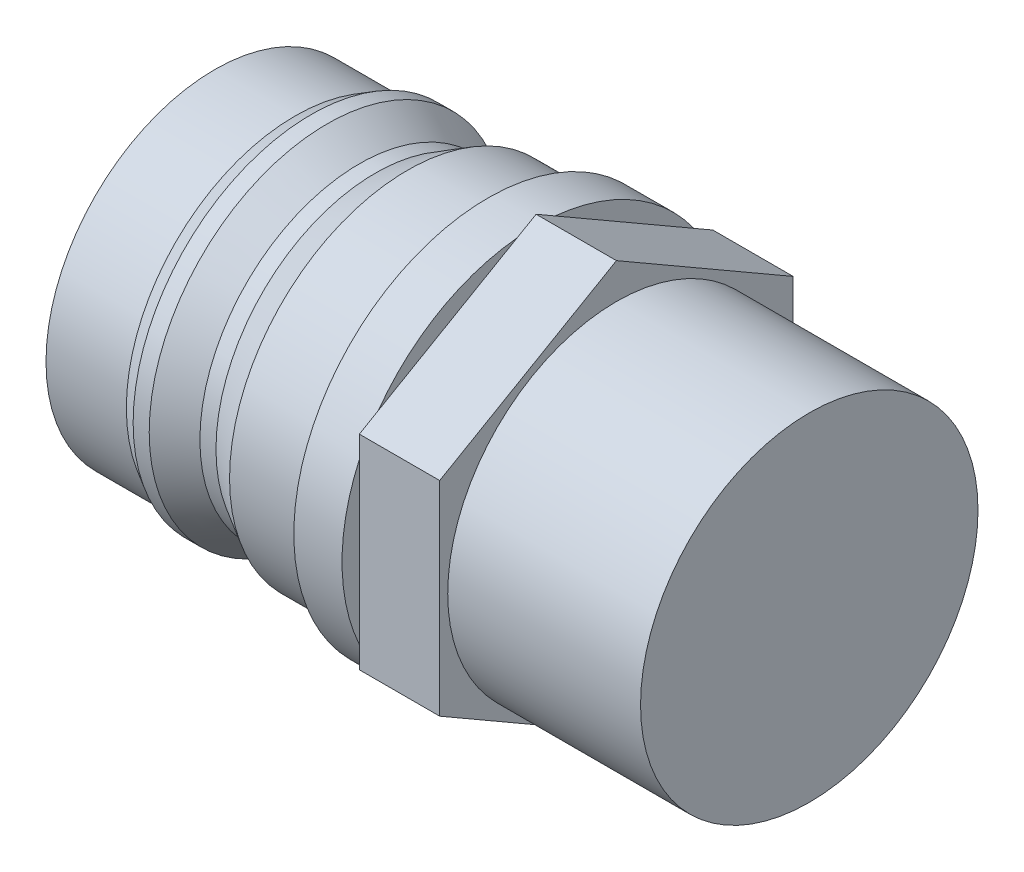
ISO-10303-21;
HEADER;
FILE_DESCRIPTION(('STEP AP214'),'2;1');
FILE_NAME('part.step','',(''),(''),'','','');
FILE_SCHEMA(('AUTOMOTIVE_DESIGN { 1 0 10303 214 1 1 1 1 }'));
ENDSEC;
DATA;
#1=APPLICATION_CONTEXT('core data for automotive mechanical design processes');
#2=APPLICATION_PROTOCOL_DEFINITION('international standard','automotive_design',2000,#1);
#3=PRODUCT_CONTEXT('',#1,'mechanical');
#4=PRODUCT('Part','Part','',(#3));
#5=PRODUCT_RELATED_PRODUCT_CATEGORY('part','',(#4));
#6=PRODUCT_DEFINITION_FORMATION('','',#4);
#7=PRODUCT_DEFINITION_CONTEXT('part definition',#1,'design');
#8=PRODUCT_DEFINITION('design','',#6,#7);
#9=PRODUCT_DEFINITION_SHAPE('','',#8);
#10=(LENGTH_UNIT() NAMED_UNIT(*) SI_UNIT(.MILLI.,.METRE.));
#11=(NAMED_UNIT(*) PLANE_ANGLE_UNIT() SI_UNIT($,.RADIAN.));
#12=(NAMED_UNIT(*) SI_UNIT($,.STERADIAN.) SOLID_ANGLE_UNIT());
#13=UNCERTAINTY_MEASURE_WITH_UNIT(LENGTH_MEASURE(1.E-05),#10,'distance_accuracy_value','');
#14=(GEOMETRIC_REPRESENTATION_CONTEXT(3) GLOBAL_UNCERTAINTY_ASSIGNED_CONTEXT((#13)) GLOBAL_UNIT_ASSIGNED_CONTEXT((#10,
#11,#12)) REPRESENTATION_CONTEXT('',''));
#15=CARTESIAN_POINT('',(0.,0.,0.));
#16=DIRECTION('',(0.,0.,1.));
#17=DIRECTION('',(1.,0.,0.));
#18=AXIS2_PLACEMENT_3D('',#15,#16,#17);
#19=CARTESIAN_POINT('',(20.,12.0773502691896,0.));
#20=DIRECTION('',(1.,0.,0.));
#21=DIRECTION('',(0.,0.,-1.));
#22=AXIS2_PLACEMENT_3D('',#19,#20,#21);
#23=PLANE('',#22);
#24=DIRECTION('',(0.,0.5,0.866025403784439));
#25=VECTOR('',#24,1.);
#26=CARTESIAN_POINT('',(20.,6.35085296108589,-11.));
#27=LINE('',#26,#25);
#28=CARTESIAN_POINT('',(20.,7.03316945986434,-9.81819315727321));
#29=VERTEX_POINT('',#28);
#30=CARTESIAN_POINT('',(20.,12.0193894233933,-1.1818068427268));
#31=VERTEX_POINT('',#30);
#32=EDGE_CURVE('E11',#29,#31,#27,.T.);
#33=ORIENTED_EDGE('',*,*,#32,.F.);
#34=CARTESIAN_POINT('',(20.,0.,0.));
#35=DIRECTION('',(1.,0.,0.));
#36=DIRECTION('',(0.,0.,-1.));
#37=AXIS2_PLACEMENT_3D('',#34,#35,#36);
#38=CIRCLE('',#37,12.0773502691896);
#39=EDGE_CURVE('E162',#29,#31,#38,.T.);
#40=ORIENTED_EDGE('',*,*,#39,.T.);
#41=EDGE_LOOP('',(#33,#40));
#42=FACE_BOUND('',#41,.T.);
#43=ADVANCED_FACE('F33',(#42),#23,.T.);
#44=DIRECTION('',(0.,1.,0.));
#45=VECTOR('',#44,1.);
#46=CARTESIAN_POINT('',(20.,-6.35085296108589,-11.));
#47=LINE('',#46,#45);
#48=CARTESIAN_POINT('',(20.,-4.98621996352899,-11.));
#49=VERTEX_POINT('',#48);
#50=CARTESIAN_POINT('',(20.,4.98621996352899,-11.));
#51=VERTEX_POINT('',#50);
#52=EDGE_CURVE('E42',#49,#51,#47,.T.);
#53=ORIENTED_EDGE('',*,*,#52,.F.);
#54=EDGE_CURVE('E152',#49,#51,#38,.T.);
#55=ORIENTED_EDGE('',*,*,#54,.T.);
#56=EDGE_LOOP('',(#53,#55));
#57=FACE_BOUND('',#56,.T.);
#58=ADVANCED_FACE('F228',(#57),#23,.T.);
#59=DIRECTION('',(0.,0.5,-0.866025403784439));
#60=VECTOR('',#59,1.);
#61=CARTESIAN_POINT('',(20.,-12.7017059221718,0.));
#62=LINE('',#61,#60);
#63=CARTESIAN_POINT('',(20.,-12.0193894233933,-1.18180684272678));
#64=VERTEX_POINT('',#63);
#65=CARTESIAN_POINT('',(20.,-7.03316945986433,-9.81819315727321));
#66=VERTEX_POINT('',#65);
#67=EDGE_CURVE('E292',#64,#66,#62,.T.);
#68=ORIENTED_EDGE('',*,*,#67,.F.);
#69=EDGE_CURVE('E316',#64,#66,#38,.T.);
#70=ORIENTED_EDGE('',*,*,#69,.T.);
#71=EDGE_LOOP('',(#68,#70));
#72=FACE_BOUND('',#71,.T.);
#73=ADVANCED_FACE('F235',(#72),#23,.T.);
#74=DIRECTION('',(0.,-0.5,-0.866025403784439));
#75=VECTOR('',#74,1.);
#76=CARTESIAN_POINT('',(20.,-6.35085296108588,11.));
#77=LINE('',#76,#75);
#78=CARTESIAN_POINT('',(20.,-7.03316945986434,9.81819315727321));
#79=VERTEX_POINT('',#78);
#80=CARTESIAN_POINT('',(20.,-12.0193894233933,1.1818068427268));
#81=VERTEX_POINT('',#80);
#82=EDGE_CURVE('E196',#79,#81,#77,.T.);
#83=ORIENTED_EDGE('',*,*,#82,.F.);
#84=EDGE_CURVE('E311',#79,#81,#38,.T.);
#85=ORIENTED_EDGE('',*,*,#84,.T.);
#86=EDGE_LOOP('',(#83,#85));
#87=FACE_BOUND('',#86,.T.);
#88=ADVANCED_FACE('F254',(#87),#23,.T.);
#89=DIRECTION('',(0.,-1.,0.));
#90=VECTOR('',#89,1.);
#91=CARTESIAN_POINT('',(20.,6.35085296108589,11.));
#92=LINE('',#91,#90);
#93=CARTESIAN_POINT('',(20.,4.98621996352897,11.));
#94=VERTEX_POINT('',#93);
#95=CARTESIAN_POINT('',(20.,-4.98621996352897,11.));
#96=VERTEX_POINT('',#95);
#97=EDGE_CURVE('E191',#94,#96,#92,.T.);
#98=ORIENTED_EDGE('',*,*,#97,.F.);
#99=EDGE_CURVE('E265',#94,#96,#38,.T.);
#100=ORIENTED_EDGE('',*,*,#99,.T.);
#101=EDGE_LOOP('',(#98,#100));
#102=FACE_BOUND('',#101,.T.);
#103=ADVANCED_FACE('F242',(#102),#23,.T.);
#104=CARTESIAN_POINT('',(0.,0.,0.));
#105=DIRECTION('',(-1.,0.,0.));
#106=DIRECTION('',(0.,0.,1.));
#107=AXIS2_PLACEMENT_3D('',#104,#105,#106);
#108=PLANE('',#107);
#109=CARTESIAN_POINT('',(0.,0.,0.));
#110=DIRECTION('',(1.,0.,0.));
#111=DIRECTION('',(0.,0.,-1.));
#112=AXIS2_PLACEMENT_3D('',#109,#110,#111);
#113=CIRCLE('',#112,10.5);
#114=CARTESIAN_POINT('',(0.,0.,-10.5));
#115=VERTEX_POINT('',#114);
#116=EDGE_CURVE('E37',#115,#115,#113,.T.);
#117=ORIENTED_EDGE('',*,*,#116,.F.);
#118=EDGE_LOOP('',(#117));
#119=FACE_BOUND('',#118,.T.);
#120=ADVANCED_FACE('F35',(#119),#108,.T.);
#121=CARTESIAN_POINT('',(20.,0.,0.));
#122=DIRECTION('',(1.,0.,0.));
#123=DIRECTION('',(0.,0.,-1.));
#124=AXIS2_PLACEMENT_3D('',#121,#122,#123);
#125=CYLINDRICAL_SURFACE('',#124,10.5);
#126=ORIENTED_EDGE('',*,*,#116,.T.);
#127=EDGE_LOOP('',(#126));
#128=FACE_BOUND('',#127,.T.);
#129=CARTESIAN_POINT('',(5.,0.,0.));
#130=DIRECTION('',(1.,0.,0.));
#131=DIRECTION('',(0.,0.,-1.));
#132=AXIS2_PLACEMENT_3D('',#129,#130,#131);
#133=CIRCLE('',#132,10.5);
#134=CARTESIAN_POINT('',(5.,0.,-10.5));
#135=VERTEX_POINT('',#134);
#136=EDGE_CURVE('E182',#135,#135,#133,.T.);
#137=ORIENTED_EDGE('',*,*,#136,.F.);
#138=EDGE_LOOP('',(#137));
#139=FACE_BOUND('',#138,.T.);
#140=ADVANCED_FACE('F260',(#128,#139),#125,.T.);
#141=CARTESIAN_POINT('',(6.,0.,0.));
#142=DIRECTION('',(1.,0.,0.));
#143=DIRECTION('',(0.,0.,-1.));
#144=AXIS2_PLACEMENT_3D('',#141,#142,#143);
#145=CONICAL_SURFACE('',#144,11.0773502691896,0.523598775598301);
#146=ORIENTED_EDGE('',*,*,#136,.T.);
#147=EDGE_LOOP('',(#146));
#148=FACE_BOUND('',#147,.T.);
#149=CARTESIAN_POINT('',(6.,0.,0.));
#150=DIRECTION('',(1.,0.,0.));
#151=DIRECTION('',(0.,0.,-1.));
#152=AXIS2_PLACEMENT_3D('',#149,#150,#151);
#153=CIRCLE('',#152,11.0773502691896);
#154=CARTESIAN_POINT('',(6.,0.,-11.0773502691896));
#155=VERTEX_POINT('',#154);
#156=EDGE_CURVE('E180',#155,#155,#153,.T.);
#157=ORIENTED_EDGE('',*,*,#156,.F.);
#158=EDGE_LOOP('',(#157));
#159=FACE_BOUND('',#158,.T.);
#160=ADVANCED_FACE('F525',(#148,#159),#145,.T.);
#161=CARTESIAN_POINT('',(20.,0.,0.));
#162=DIRECTION('',(1.,0.,0.));
#163=DIRECTION('',(0.,0.,-1.));
#164=AXIS2_PLACEMENT_3D('',#161,#162,#163);
#165=CYLINDRICAL_SURFACE('',#164,11.0773502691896);
#166=ORIENTED_EDGE('',*,*,#156,.T.);
#167=EDGE_LOOP('',(#166));
#168=FACE_BOUND('',#167,.T.);
#169=CARTESIAN_POINT('',(7.,0.,0.));
#170=DIRECTION('',(1.,0.,0.));
#171=DIRECTION('',(0.,0.,-1.));
#172=AXIS2_PLACEMENT_3D('',#169,#170,#171);
#173=CIRCLE('',#172,11.0773502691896);
#174=CARTESIAN_POINT('',(7.,0.,-11.0773502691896));
#175=VERTEX_POINT('',#174);
#176=EDGE_CURVE('E177',#175,#175,#173,.T.);
#177=ORIENTED_EDGE('',*,*,#176,.F.);
#178=EDGE_LOOP('',(#177));
#179=FACE_BOUND('',#178,.T.);
#180=ADVANCED_FACE('F514',(#168,#179),#165,.T.);
#181=CARTESIAN_POINT('',(9.,0.,0.));
#182=DIRECTION('',(-1.,0.,0.));
#183=DIRECTION('',(0.,0.,1.));
#184=AXIS2_PLACEMENT_3D('',#181,#182,#183);
#185=CONICAL_SURFACE('',#184,9.92264973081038,0.523598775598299);
#186=ORIENTED_EDGE('',*,*,#176,.T.);
#187=EDGE_LOOP('',(#186));
#188=FACE_BOUND('',#187,.T.);
#189=CARTESIAN_POINT('',(9.,0.,0.));
#190=DIRECTION('',(1.,0.,0.));
#191=DIRECTION('',(0.,0.,-1.));
#192=AXIS2_PLACEMENT_3D('',#189,#190,#191);
#193=CIRCLE('',#192,9.92264973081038);
#194=CARTESIAN_POINT('',(9.,0.,-9.92264973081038));
#195=VERTEX_POINT('',#194);
#196=EDGE_CURVE('E174',#195,#195,#193,.T.);
#197=ORIENTED_EDGE('',*,*,#196,.F.);
#198=EDGE_LOOP('',(#197));
#199=FACE_BOUND('',#198,.T.);
#200=ADVANCED_FACE('F504',(#188,#199),#185,.T.);
#201=CARTESIAN_POINT('',(20.,0.,0.));
#202=DIRECTION('',(1.,0.,0.));
#203=DIRECTION('',(0.,0.,-1.));
#204=AXIS2_PLACEMENT_3D('',#201,#202,#203);
#205=CYLINDRICAL_SURFACE('',#204,9.92264973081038);
#206=ORIENTED_EDGE('',*,*,#196,.T.);
#207=EDGE_LOOP('',(#206));
#208=FACE_BOUND('',#207,.T.);
#209=CARTESIAN_POINT('',(10.,0.,0.));
#210=DIRECTION('',(1.,0.,0.));
#211=DIRECTION('',(0.,0.,-1.));
#212=AXIS2_PLACEMENT_3D('',#209,#210,#211);
#213=CIRCLE('',#212,9.92264973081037);
#214=CARTESIAN_POINT('',(10.,0.,-9.92264973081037));
#215=VERTEX_POINT('',#214);
#216=EDGE_CURVE('E171',#215,#215,#213,.T.);
#217=ORIENTED_EDGE('',*,*,#216,.F.);
#218=EDGE_LOOP('',(#217));
#219=FACE_BOUND('',#218,.T.);
#220=ADVANCED_FACE('F492',(#208,#219),#205,.T.);
#221=CARTESIAN_POINT('',(12.,0.,0.));
#222=DIRECTION('',(1.,0.,0.));
#223=DIRECTION('',(0.,0.,-1.));
#224=AXIS2_PLACEMENT_3D('',#221,#222,#223);
#225=CONICAL_SURFACE('',#224,11.0773502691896,0.523598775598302);
#226=ORIENTED_EDGE('',*,*,#216,.T.);
#227=EDGE_LOOP('',(#226));
#228=FACE_BOUND('',#227,.T.);
#229=CARTESIAN_POINT('',(12.,0.,0.));
#230=DIRECTION('',(1.,0.,0.));
#231=DIRECTION('',(0.,0.,-1.));
#232=AXIS2_PLACEMENT_3D('',#229,#230,#231);
#233=CIRCLE('',#232,11.0773502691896);
#234=CARTESIAN_POINT('',(12.,0.,-11.0773502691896));
#235=VERTEX_POINT('',#234);
#236=EDGE_CURVE('E168',#235,#235,#233,.T.);
#237=ORIENTED_EDGE('',*,*,#236,.F.);
#238=EDGE_LOOP('',(#237));
#239=FACE_BOUND('',#238,.T.);
#240=ADVANCED_FACE('F483',(#228,#239),#225,.T.);
#241=CARTESIAN_POINT('',(20.,0.,0.));
#242=DIRECTION('',(1.,0.,0.));
#243=DIRECTION('',(0.,0.,-1.));
#244=AXIS2_PLACEMENT_3D('',#241,#242,#243);
#245=CYLINDRICAL_SURFACE('',#244,11.0773502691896);
#246=ORIENTED_EDGE('',*,*,#236,.T.);
#247=EDGE_LOOP('',(#246));
#248=FACE_BOUND('',#247,.T.);
#249=CARTESIAN_POINT('',(17.,0.,0.));
#250=DIRECTION('',(1.,0.,0.));
#251=DIRECTION('',(0.,0.,-1.));
#252=AXIS2_PLACEMENT_3D('',#249,#250,#251);
#253=CIRCLE('',#252,11.0773502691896);
#254=CARTESIAN_POINT('',(17.,0.,-11.0773502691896));
#255=VERTEX_POINT('',#254);
#256=EDGE_CURVE('E165',#255,#255,#253,.T.);
#257=ORIENTED_EDGE('',*,*,#256,.F.);
#258=EDGE_LOOP('',(#257));
#259=FACE_BOUND('',#258,.T.);
#260=ADVANCED_FACE('F474',(#248,#259),#245,.T.);
#261=CARTESIAN_POINT('',(17.,11.0773502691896,0.));
#262=DIRECTION('',(-1.,0.,0.));
#263=DIRECTION('',(0.,0.,1.));
#264=AXIS2_PLACEMENT_3D('',#261,#262,#263);
#265=PLANE('',#264);
#266=ORIENTED_EDGE('',*,*,#256,.T.);
#267=EDGE_LOOP('',(#266));
#268=FACE_BOUND('',#267,.T.);
#269=CARTESIAN_POINT('',(17.,0.,0.));
#270=DIRECTION('',(1.,0.,0.));
#271=DIRECTION('',(0.,0.,-1.));
#272=AXIS2_PLACEMENT_3D('',#269,#270,#271);
#273=CIRCLE('',#272,12.0773502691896);
#274=CARTESIAN_POINT('',(17.,0.,-12.0773502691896));
#275=VERTEX_POINT('',#274);
#276=EDGE_CURVE('E161',#275,#275,#273,.T.);
#277=ORIENTED_EDGE('',*,*,#276,.F.);
#278=EDGE_LOOP('',(#277));
#279=FACE_BOUND('',#278,.T.);
#280=ADVANCED_FACE('F251',(#268,#279),#265,.T.);
#281=CARTESIAN_POINT('',(20.,0.,0.));
#282=DIRECTION('',(1.,0.,0.));
#283=DIRECTION('',(0.,0.,-1.));
#284=AXIS2_PLACEMENT_3D('',#281,#282,#283);
#285=CYLINDRICAL_SURFACE('',#284,12.0773502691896);
#286=ORIENTED_EDGE('',*,*,#276,.T.);
#287=EDGE_LOOP('',(#286));
#288=FACE_BOUND('',#287,.T.);
#289=EDGE_CURVE('E155',#51,#29,#38,.T.);
#290=ORIENTED_EDGE('',*,*,#289,.F.);
#291=ORIENTED_EDGE('',*,*,#54,.F.);
#292=EDGE_CURVE('E57',#66,#49,#38,.T.);
#293=ORIENTED_EDGE('',*,*,#292,.F.);
#294=ORIENTED_EDGE('',*,*,#69,.F.);
#295=EDGE_CURVE('E313',#81,#64,#38,.T.);
#296=ORIENTED_EDGE('',*,*,#295,.F.);
#297=ORIENTED_EDGE('',*,*,#84,.F.);
#298=EDGE_CURVE('E276',#96,#79,#38,.T.);
#299=ORIENTED_EDGE('',*,*,#298,.F.);
#300=ORIENTED_EDGE('',*,*,#99,.F.);
#301=CARTESIAN_POINT('',(20.,7.03316945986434,9.81819315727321));
#302=VERTEX_POINT('',#301);
#303=EDGE_CURVE('E273',#302,#94,#38,.T.);
#304=ORIENTED_EDGE('',*,*,#303,.F.);
#305=CARTESIAN_POINT('',(20.,12.0193894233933,1.18180684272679));
#306=VERTEX_POINT('',#305);
#307=EDGE_CURVE('E280',#306,#302,#38,.T.);
#308=ORIENTED_EDGE('',*,*,#307,.F.);
#309=EDGE_CURVE('E579',#31,#306,#38,.T.);
#310=ORIENTED_EDGE('',*,*,#309,.F.);
#311=ORIENTED_EDGE('',*,*,#39,.F.);
#312=EDGE_LOOP('',(#290,#291,#293,#294,#296,#297,#299,#300,#304,#308,#310,#311));
#313=FACE_BOUND('',#312,.T.);
#314=ADVANCED_FACE('F240',(#288,#313),#285,.T.);
#315=DIRECTION('',(0.,-0.5,0.866025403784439));
#316=VECTOR('',#315,1.);
#317=CARTESIAN_POINT('',(20.,12.7017059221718,0.));
#318=LINE('',#317,#316);
#319=EDGE_CURVE('E187',#306,#302,#318,.T.);
#320=ORIENTED_EDGE('',*,*,#319,.F.);
#321=ORIENTED_EDGE('',*,*,#307,.T.);
#322=EDGE_LOOP('',(#320,#321));
#323=FACE_BOUND('',#322,.T.);
#324=ADVANCED_FACE('F231',(#323),#23,.T.);
#325=CARTESIAN_POINT('',(20.,0.,0.));
#326=DIRECTION('',(1.,0.,0.));
#327=DIRECTION('',(0.,0.,-1.));
#328=AXIS2_PLACEMENT_3D('',#325,#326,#327);
#329=PLANE('',#328);
#330=CARTESIAN_POINT('',(20.,6.35085296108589,-11.));
#331=VERTEX_POINT('',#330);
#332=EDGE_CURVE('E291',#51,#331,#47,.T.);
#333=ORIENTED_EDGE('',*,*,#332,.F.);
#334=ORIENTED_EDGE('',*,*,#289,.T.);
#335=EDGE_CURVE('E44',#331,#29,#27,.T.);
#336=ORIENTED_EDGE('',*,*,#335,.F.);
#337=EDGE_LOOP('',(#333,#334,#336));
#338=FACE_BOUND('',#337,.T.);
#339=ADVANCED_FACE('F239',(#338),#329,.F.);
#340=CARTESIAN_POINT('',(20.,12.7017059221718,0.));
#341=VERTEX_POINT('',#340);
#342=EDGE_CURVE('E45',#31,#341,#27,.T.);
#343=ORIENTED_EDGE('',*,*,#342,.F.);
#344=ORIENTED_EDGE('',*,*,#309,.T.);
#345=EDGE_CURVE('E193',#341,#306,#318,.T.);
#346=ORIENTED_EDGE('',*,*,#345,.F.);
#347=EDGE_LOOP('',(#343,#344,#346));
#348=FACE_BOUND('',#347,.T.);
#349=ADVANCED_FACE('F247',(#348),#329,.F.);
#350=CARTESIAN_POINT('',(20.,6.35085296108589,11.));
#351=VERTEX_POINT('',#350);
#352=EDGE_CURVE('E194',#302,#351,#318,.T.);
#353=ORIENTED_EDGE('',*,*,#352,.F.);
#354=ORIENTED_EDGE('',*,*,#303,.T.);
#355=EDGE_CURVE('E198',#351,#94,#92,.T.);
#356=ORIENTED_EDGE('',*,*,#355,.F.);
#357=EDGE_LOOP('',(#353,#354,#356));
#358=FACE_BOUND('',#357,.T.);
#359=ADVANCED_FACE('F279',(#358),#329,.F.);
#360=CARTESIAN_POINT('',(20.,-6.35085296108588,11.));
#361=VERTEX_POINT('',#360);
#362=EDGE_CURVE('E199',#96,#361,#92,.T.);
#363=ORIENTED_EDGE('',*,*,#362,.F.);
#364=ORIENTED_EDGE('',*,*,#298,.T.);
#365=EDGE_CURVE('E283',#361,#79,#77,.T.);
#366=ORIENTED_EDGE('',*,*,#365,.F.);
#367=EDGE_LOOP('',(#363,#364,#366));
#368=FACE_BOUND('',#367,.T.);
#369=ADVANCED_FACE('F310',(#368),#329,.F.);
#370=CARTESIAN_POINT('',(20.,-12.7017059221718,0.));
#371=VERTEX_POINT('',#370);
#372=EDGE_CURVE('E282',#81,#371,#77,.T.);
#373=ORIENTED_EDGE('',*,*,#372,.F.);
#374=ORIENTED_EDGE('',*,*,#295,.T.);
#375=EDGE_CURVE('E288',#371,#64,#62,.T.);
#376=ORIENTED_EDGE('',*,*,#375,.F.);
#377=EDGE_LOOP('',(#373,#374,#376));
#378=FACE_BOUND('',#377,.T.);
#379=ADVANCED_FACE('F330',(#378),#329,.F.);
#380=CARTESIAN_POINT('',(20.,-6.35085296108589,-11.));
#381=VERTEX_POINT('',#380);
#382=EDGE_CURVE('E287',#66,#381,#62,.T.);
#383=ORIENTED_EDGE('',*,*,#382,.F.);
#384=ORIENTED_EDGE('',*,*,#292,.T.);
#385=EDGE_CURVE('E146',#381,#49,#47,.T.);
#386=ORIENTED_EDGE('',*,*,#385,.F.);
#387=EDGE_LOOP('',(#383,#384,#386));
#388=FACE_BOUND('',#387,.T.);
#389=ADVANCED_FACE('F250',(#388),#329,.F.);
#390=CARTESIAN_POINT('',(25.,6.35085296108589,-11.));
#391=DIRECTION('',(0.,-0.866025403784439,0.5));
#392=DIRECTION('',(0.,-0.5,-0.866025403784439));
#393=AXIS2_PLACEMENT_3D('',#390,#391,#392);
#394=PLANE('',#393);
#395=ORIENTED_EDGE('',*,*,#335,.T.);
#396=ORIENTED_EDGE('',*,*,#32,.T.);
#397=ORIENTED_EDGE('',*,*,#342,.T.);
#398=DIRECTION('',(-1.,0.,0.));
#399=VECTOR('',#398,1.);
#400=CARTESIAN_POINT('',(25.,12.7017059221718,0.));
#401=LINE('',#400,#399);
#402=CARTESIAN_POINT('',(25.,12.7017059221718,0.));
#403=VERTEX_POINT('',#402);
#404=EDGE_CURVE('E131',#403,#341,#401,.T.);
#405=ORIENTED_EDGE('',*,*,#404,.F.);
#406=DIRECTION('',(0.,0.5,0.866025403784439));
#407=VECTOR('',#406,1.);
#408=CARTESIAN_POINT('',(25.,6.35085296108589,-11.));
#409=LINE('',#408,#407);
#410=CARTESIAN_POINT('',(25.,6.35085296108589,-11.));
#411=VERTEX_POINT('',#410);
#412=EDGE_CURVE('E137',#411,#403,#409,.T.);
#413=ORIENTED_EDGE('',*,*,#412,.F.);
#414=DIRECTION('',(-1.,0.,0.));
#415=VECTOR('',#414,1.);
#416=CARTESIAN_POINT('',(25.,6.35085296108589,-11.));
#417=LINE('',#416,#415);
#418=EDGE_CURVE('E205',#411,#331,#417,.T.);
#419=ORIENTED_EDGE('',*,*,#418,.T.);
#420=EDGE_LOOP('',(#395,#396,#397,#405,#413,#419));
#421=FACE_BOUND('',#420,.T.);
#422=ADVANCED_FACE('F149',(#421),#394,.F.);
#423=CARTESIAN_POINT('',(25.,12.7017059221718,0.));
#424=DIRECTION('',(0.,-0.866025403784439,-0.5));
#425=DIRECTION('',(0.,0.5,-0.866025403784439));
#426=AXIS2_PLACEMENT_3D('',#423,#424,#425);
#427=PLANE('',#426);
#428=ORIENTED_EDGE('',*,*,#345,.T.);
#429=ORIENTED_EDGE('',*,*,#319,.T.);
#430=ORIENTED_EDGE('',*,*,#352,.T.);
#431=DIRECTION('',(-1.,0.,0.));
#432=VECTOR('',#431,1.);
#433=CARTESIAN_POINT('',(25.,6.35085296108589,11.));
#434=LINE('',#433,#432);
#435=CARTESIAN_POINT('',(25.,6.35085296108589,11.));
#436=VERTEX_POINT('',#435);
#437=EDGE_CURVE('E133',#436,#351,#434,.T.);
#438=ORIENTED_EDGE('',*,*,#437,.F.);
#439=DIRECTION('',(0.,-0.5,0.866025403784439));
#440=VECTOR('',#439,1.);
#441=CARTESIAN_POINT('',(25.,12.7017059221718,0.));
#442=LINE('',#441,#440);
#443=EDGE_CURVE('E126',#403,#436,#442,.T.);
#444=ORIENTED_EDGE('',*,*,#443,.F.);
#445=ORIENTED_EDGE('',*,*,#404,.T.);
#446=EDGE_LOOP('',(#428,#429,#430,#438,#444,#445));
#447=FACE_BOUND('',#446,.T.);
#448=ADVANCED_FACE('F129',(#447),#427,.F.);
#449=CARTESIAN_POINT('',(25.,6.35085296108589,11.));
#450=DIRECTION('',(0.,0.,-1.));
#451=DIRECTION('',(-1.,0.,0.));
#452=AXIS2_PLACEMENT_3D('',#449,#450,#451);
#453=PLANE('',#452);
#454=ORIENTED_EDGE('',*,*,#355,.T.);
#455=ORIENTED_EDGE('',*,*,#97,.T.);
#456=ORIENTED_EDGE('',*,*,#362,.T.);
#457=DIRECTION('',(-1.,0.,0.));
#458=VECTOR('',#457,1.);
#459=CARTESIAN_POINT('',(25.,-6.35085296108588,11.));
#460=LINE('',#459,#458);
#461=CARTESIAN_POINT('',(25.,-6.35085296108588,11.));
#462=VERTEX_POINT('',#461);
#463=EDGE_CURVE('E156',#462,#361,#460,.T.);
#464=ORIENTED_EDGE('',*,*,#463,.F.);
#465=DIRECTION('',(0.,-1.,0.));
#466=VECTOR('',#465,1.);
#467=CARTESIAN_POINT('',(25.,6.35085296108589,11.));
#468=LINE('',#467,#466);
#469=EDGE_CURVE('E136',#436,#462,#468,.T.);
#470=ORIENTED_EDGE('',*,*,#469,.F.);
#471=ORIENTED_EDGE('',*,*,#437,.T.);
#472=EDGE_LOOP('',(#454,#455,#456,#464,#470,#471));
#473=FACE_BOUND('',#472,.T.);
#474=ADVANCED_FACE('F281',(#473),#453,.F.);
#475=CARTESIAN_POINT('',(25.,-6.35085296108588,11.));
#476=DIRECTION('',(0.,0.866025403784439,-0.5));
#477=DIRECTION('',(0.,0.5,0.866025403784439));
#478=AXIS2_PLACEMENT_3D('',#475,#476,#477);
#479=PLANE('',#478);
#480=ORIENTED_EDGE('',*,*,#365,.T.);
#481=ORIENTED_EDGE('',*,*,#82,.T.);
#482=ORIENTED_EDGE('',*,*,#372,.T.);
#483=DIRECTION('',(-1.,0.,0.));
#484=VECTOR('',#483,1.);
#485=CARTESIAN_POINT('',(25.,-12.7017059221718,0.));
#486=LINE('',#485,#484);
#487=CARTESIAN_POINT('',(25.,-12.7017059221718,0.));
#488=VERTEX_POINT('',#487);
#489=EDGE_CURVE('E299',#488,#371,#486,.T.);
#490=ORIENTED_EDGE('',*,*,#489,.F.);
#491=DIRECTION('',(0.,-0.5,-0.866025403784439));
#492=VECTOR('',#491,1.);
#493=CARTESIAN_POINT('',(25.,-6.35085296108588,11.));
#494=LINE('',#493,#492);
#495=EDGE_CURVE('E208',#462,#488,#494,.T.);
#496=ORIENTED_EDGE('',*,*,#495,.F.);
#497=ORIENTED_EDGE('',*,*,#463,.T.);
#498=EDGE_LOOP('',(#480,#481,#482,#490,#496,#497));
#499=FACE_BOUND('',#498,.T.);
#500=ADVANCED_FACE('F306',(#499),#479,.F.);
#501=CARTESIAN_POINT('',(25.,-12.7017059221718,0.));
#502=DIRECTION('',(0.,0.866025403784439,0.5));
#503=DIRECTION('',(0.,-0.5,0.866025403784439));
#504=AXIS2_PLACEMENT_3D('',#501,#502,#503);
#505=PLANE('',#504);
#506=ORIENTED_EDGE('',*,*,#375,.T.);
#507=ORIENTED_EDGE('',*,*,#67,.T.);
#508=ORIENTED_EDGE('',*,*,#382,.T.);
#509=DIRECTION('',(-1.,0.,0.));
#510=VECTOR('',#509,1.);
#511=CARTESIAN_POINT('',(25.,-6.35085296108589,-11.));
#512=LINE('',#511,#510);
#513=CARTESIAN_POINT('',(25.,-6.35085296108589,-11.));
#514=VERTEX_POINT('',#513);
#515=EDGE_CURVE('E296',#514,#381,#512,.T.);
#516=ORIENTED_EDGE('',*,*,#515,.F.);
#517=DIRECTION('',(0.,0.5,-0.866025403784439));
#518=VECTOR('',#517,1.);
#519=CARTESIAN_POINT('',(25.,-12.7017059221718,0.));
#520=LINE('',#519,#518);
#521=EDGE_CURVE('E206',#488,#514,#520,.T.);
#522=ORIENTED_EDGE('',*,*,#521,.F.);
#523=ORIENTED_EDGE('',*,*,#489,.T.);
#524=EDGE_LOOP('',(#506,#507,#508,#516,#522,#523));
#525=FACE_BOUND('',#524,.T.);
#526=ADVANCED_FACE('F329',(#525),#505,.F.);
#527=CARTESIAN_POINT('',(25.,-6.35085296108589,-11.));
#528=DIRECTION('',(0.,0.,1.));
#529=DIRECTION('',(1.,0.,0.));
#530=AXIS2_PLACEMENT_3D('',#527,#528,#529);
#531=PLANE('',#530);
#532=ORIENTED_EDGE('',*,*,#385,.T.);
#533=ORIENTED_EDGE('',*,*,#52,.T.);
#534=ORIENTED_EDGE('',*,*,#332,.T.);
#535=ORIENTED_EDGE('',*,*,#418,.F.);
#536=DIRECTION('',(0.,1.,0.));
#537=VECTOR('',#536,1.);
#538=CARTESIAN_POINT('',(25.,-6.35085296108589,-11.));
#539=LINE('',#538,#537);
#540=EDGE_CURVE('E142',#514,#411,#539,.T.);
#541=ORIENTED_EDGE('',*,*,#540,.F.);
#542=ORIENTED_EDGE('',*,*,#515,.T.);
#543=EDGE_LOOP('',(#532,#533,#534,#535,#541,#542));
#544=FACE_BOUND('',#543,.T.);
#545=ADVANCED_FACE('F325',(#544),#531,.F.);
#546=CARTESIAN_POINT('',(25.,0.,0.));
#547=DIRECTION('',(1.,0.,0.));
#548=DIRECTION('',(0.,0.,-1.));
#549=AXIS2_PLACEMENT_3D('',#546,#547,#548);
#550=PLANE('',#549);
#551=CARTESIAN_POINT('',(25.,0.,0.));
#552=DIRECTION('',(-1.,0.,0.));
#553=DIRECTION('',(0.,0.,1.));
#554=AXIS2_PLACEMENT_3D('',#551,#552,#553);
#555=CIRCLE('',#554,10.5);
#556=CARTESIAN_POINT('',(25.,0.,10.5));
#557=VERTEX_POINT('',#556);
#558=EDGE_CURVE('E202',#557,#557,#555,.T.);
#559=ORIENTED_EDGE('',*,*,#558,.T.);
#560=EDGE_LOOP('',(#559));
#561=FACE_BOUND('',#560,.T.);
#562=ORIENTED_EDGE('',*,*,#412,.T.);
#563=ORIENTED_EDGE('',*,*,#443,.T.);
#564=ORIENTED_EDGE('',*,*,#469,.T.);
#565=ORIENTED_EDGE('',*,*,#495,.T.);
#566=ORIENTED_EDGE('',*,*,#521,.T.);
#567=ORIENTED_EDGE('',*,*,#540,.T.);
#568=EDGE_LOOP('',(#562,#563,#564,#565,#566,#567));
#569=FACE_BOUND('',#568,.T.);
#570=ADVANCED_FACE('F140',(#561,#569),#550,.T.);
#571=CARTESIAN_POINT('',(25.,0.,0.));
#572=DIRECTION('',(-1.,0.,0.));
#573=DIRECTION('',(0.,0.,1.));
#574=AXIS2_PLACEMENT_3D('',#571,#572,#573);
#575=CYLINDRICAL_SURFACE('',#574,10.5);
#576=ORIENTED_EDGE('',*,*,#558,.F.);
#577=EDGE_LOOP('',(#576));
#578=FACE_BOUND('',#577,.T.);
#579=CARTESIAN_POINT('',(37.,0.,0.));
#580=DIRECTION('',(-1.,0.,0.));
#581=DIRECTION('',(0.,0.,1.));
#582=AXIS2_PLACEMENT_3D('',#579,#580,#581);
#583=CIRCLE('',#582,10.5);
#584=CARTESIAN_POINT('',(37.,0.,10.5));
#585=VERTEX_POINT('',#584);
#586=EDGE_CURVE('E213',#585,#585,#583,.T.);
#587=ORIENTED_EDGE('',*,*,#586,.T.);
#588=EDGE_LOOP('',(#587));
#589=FACE_BOUND('',#588,.T.);
#590=ADVANCED_FACE('F217',(#578,#589),#575,.T.);
#591=CARTESIAN_POINT('',(37.,10.5,0.));
#592=DIRECTION('',(-1.,0.,0.));
#593=DIRECTION('',(0.,0.,1.));
#594=AXIS2_PLACEMENT_3D('',#591,#592,#593);
#595=PLANE('',#594);
#596=ORIENTED_EDGE('',*,*,#586,.F.);
#597=EDGE_LOOP('',(#596));
#598=FACE_BOUND('',#597,.T.);
#599=ADVANCED_FACE('F219',(#598),#595,.F.);
#600=CLOSED_SHELL('',(#43,#58,#73,#88,#103,#120,#140,#160,#180,#200,#220,#240,#260,#280,#314,
#324,#339,#349,#359,#369,#379,#389,#422,#448,#474,#500,#526,#545,#570,#590,#599));
#601=MANIFOLD_SOLID_BREP('B2',#600);
#602=ADVANCED_BREP_SHAPE_REPRESENTATION('',(#18,#601),#14);
#603=SHAPE_DEFINITION_REPRESENTATION(#9,#602);
ENDSEC;
END-ISO-10303-21;
